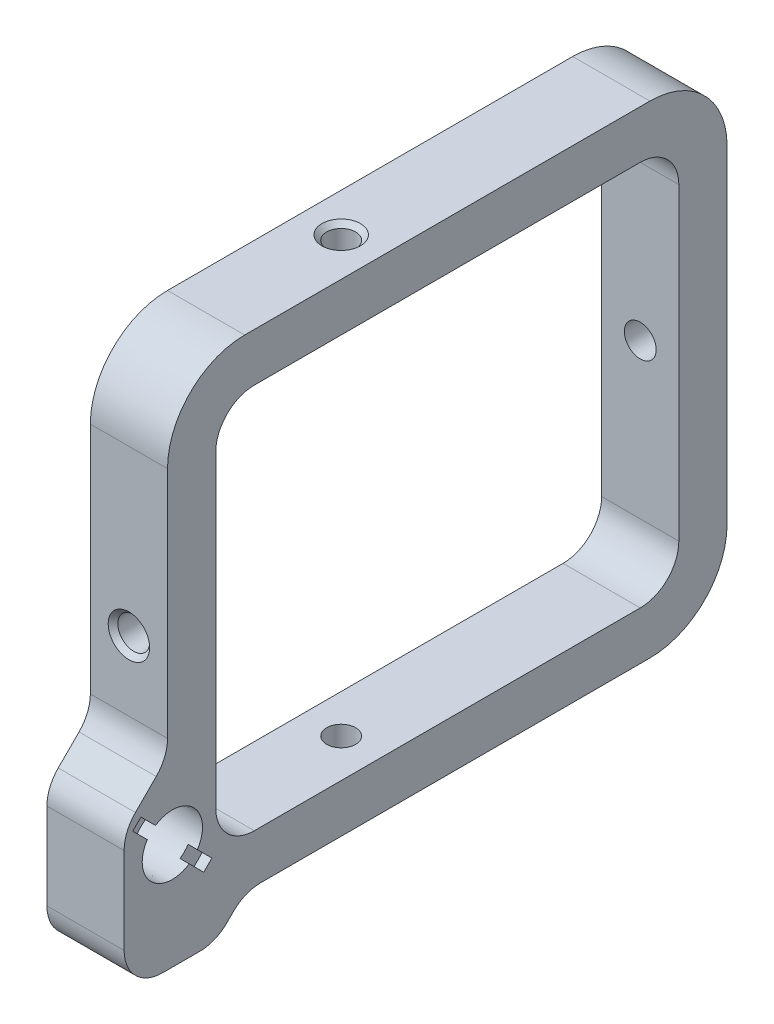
ISO-10303-21;
HEADER;
FILE_DESCRIPTION(('STEP AP214'),'2;1');
FILE_NAME('part.step','',(''),(''),'','','');
FILE_SCHEMA(('AUTOMOTIVE_DESIGN { 1 0 10303 214 1 1 1 1 }'));
ENDSEC;
DATA;
#1=APPLICATION_CONTEXT('core data for automotive mechanical design processes');
#2=APPLICATION_PROTOCOL_DEFINITION('international standard','automotive_design',2000,#1);
#3=PRODUCT_CONTEXT('',#1,'mechanical');
#4=PRODUCT('Part','Part','',(#3));
#5=PRODUCT_RELATED_PRODUCT_CATEGORY('part','',(#4));
#6=PRODUCT_DEFINITION_FORMATION('','',#4);
#7=PRODUCT_DEFINITION_CONTEXT('part definition',#1,'design');
#8=PRODUCT_DEFINITION('design','',#6,#7);
#9=PRODUCT_DEFINITION_SHAPE('','',#8);
#10=(LENGTH_UNIT() NAMED_UNIT(*) SI_UNIT(.MILLI.,.METRE.));
#11=(NAMED_UNIT(*) PLANE_ANGLE_UNIT() SI_UNIT($,.RADIAN.));
#12=(NAMED_UNIT(*) SI_UNIT($,.STERADIAN.) SOLID_ANGLE_UNIT());
#13=UNCERTAINTY_MEASURE_WITH_UNIT(LENGTH_MEASURE(1.E-05),#10,'distance_accuracy_value','');
#14=(GEOMETRIC_REPRESENTATION_CONTEXT(3) GLOBAL_UNCERTAINTY_ASSIGNED_CONTEXT((#13)) GLOBAL_UNIT_ASSIGNED_CONTEXT((#10,
#11,#12)) REPRESENTATION_CONTEXT('',''));
#15=CARTESIAN_POINT('',(0.,0.,0.));
#16=DIRECTION('',(0.,0.,1.));
#17=DIRECTION('',(1.,0.,0.));
#18=AXIS2_PLACEMENT_3D('',#15,#16,#17);
#19=CARTESIAN_POINT('',(8.,0.,0.));
#20=DIRECTION('',(1.,0.,0.));
#21=DIRECTION('',(0.,0.,-1.));
#22=AXIS2_PLACEMENT_3D('',#19,#20,#21);
#23=PLANE('',#22);
#24=DIRECTION('',(0.,0.707106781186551,0.707106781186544));
#25=VECTOR('',#24,1.);
#26=CARTESIAN_POINT('',(8.,-12.898780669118,60.7526911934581));
#27=LINE('',#26,#25);
#28=CARTESIAN_POINT('',(8.,-20.2526911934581,53.398780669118));
#29=VERTEX_POINT('',#28);
#30=CARTESIAN_POINT('',(8.,-18.7443328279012,54.907139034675));
#31=VERTEX_POINT('',#30);
#32=EDGE_CURVE('E284',#29,#31,#27,.T.);
#33=ORIENTED_EDGE('',*,*,#32,.F.);
#34=DIRECTION('',(0.,0.707106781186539,-0.707106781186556));
#35=VECTOR('',#34,1.);
#36=CARTESIAN_POINT('',(8.,-20.2526911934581,53.398780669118));
#37=LINE('',#36,#35);
#38=CARTESIAN_POINT('',(8.,-21.101219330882,54.2473088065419));
#39=VERTEX_POINT('',#38);
#40=EDGE_CURVE('E262',#39,#29,#37,.T.);
#41=ORIENTED_EDGE('',*,*,#40,.F.);
#42=DIRECTION('',(0.,-0.707106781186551,-0.707106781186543));
#43=VECTOR('',#42,1.);
#44=CARTESIAN_POINT('',(8.,-21.101219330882,54.2473088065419));
#45=LINE('',#44,#43);
#46=CARTESIAN_POINT('',(8.,-19.592860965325,55.7556671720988));
#47=VERTEX_POINT('',#46);
#48=EDGE_CURVE('E289',#47,#39,#45,.T.);
#49=ORIENTED_EDGE('',*,*,#48,.F.);
#50=CARTESIAN_POINT('',(8.,-17.,57.5));
#51=DIRECTION('',(1.,0.,0.));
#52=DIRECTION('',(0.,0.,-1.));
#53=AXIS2_PLACEMENT_3D('',#50,#51,#52);
#54=CIRCLE('',#53,3.125);
#55=CARTESIAN_POINT('',(8.,-15.2556671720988,60.092860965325));
#56=VERTEX_POINT('',#55);
#57=EDGE_CURVE('E311',#56,#47,#54,.T.);
#58=ORIENTED_EDGE('',*,*,#57,.F.);
#59=CARTESIAN_POINT('',(8.,-13.7473088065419,61.6012193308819));
#60=VERTEX_POINT('',#59);
#61=EDGE_CURVE('E290',#60,#56,#45,.T.);
#62=ORIENTED_EDGE('',*,*,#61,.F.);
#63=DIRECTION('',(0.,-0.707106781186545,0.70710678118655));
#64=VECTOR('',#63,1.);
#65=CARTESIAN_POINT('',(8.,-13.7473088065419,61.6012193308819));
#66=LINE('',#65,#64);
#67=CARTESIAN_POINT('',(8.,-12.898780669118,60.7526911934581));
#68=VERTEX_POINT('',#67);
#69=EDGE_CURVE('E287',#68,#60,#66,.T.);
#70=ORIENTED_EDGE('',*,*,#69,.F.);
#71=CARTESIAN_POINT('',(8.,-14.407139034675,59.2443328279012));
#72=VERTEX_POINT('',#71);
#73=EDGE_CURVE('E268',#72,#68,#27,.T.);
#74=ORIENTED_EDGE('',*,*,#73,.F.);
#75=EDGE_CURVE('E308',#31,#72,#54,.T.);
#76=ORIENTED_EDGE('',*,*,#75,.F.);
#77=EDGE_LOOP('',(#33,#41,#49,#58,#62,#70,#74,#76));
#78=FACE_BOUND('',#77,.T.);
#79=DIRECTION('',(0.,-1.,0.));
#80=VECTOR('',#79,1.);
#81=CARTESIAN_POINT('',(8.,20.,53.));
#82=LINE('',#81,#80);
#83=CARTESIAN_POINT('',(8.,16.,53.));
#84=VERTEX_POINT('',#83);
#85=CARTESIAN_POINT('',(8.,-16.,53.));
#86=VERTEX_POINT('',#85);
#87=EDGE_CURVE('E315',#84,#86,#82,.T.);
#88=ORIENTED_EDGE('',*,*,#87,.F.);
#89=CARTESIAN_POINT('',(8.,16.,49.));
#90=DIRECTION('',(1.,0.,0.));
#91=DIRECTION('',(0.,0.,-1.));
#92=AXIS2_PLACEMENT_3D('',#89,#90,#91);
#93=CIRCLE('',#92,4.);
#94=CARTESIAN_POINT('',(8.,20.,49.));
#95=VERTEX_POINT('',#94);
#96=EDGE_CURVE('E518',#84,#95,#93,.F.);
#97=ORIENTED_EDGE('',*,*,#96,.T.);
#98=DIRECTION('',(0.,0.,1.));
#99=VECTOR('',#98,1.);
#100=CARTESIAN_POINT('',(8.,20.,5.));
#101=LINE('',#100,#99);
#102=CARTESIAN_POINT('',(8.,20.,9.));
#103=VERTEX_POINT('',#102);
#104=EDGE_CURVE('E312',#103,#95,#101,.T.);
#105=ORIENTED_EDGE('',*,*,#104,.F.);
#106=CARTESIAN_POINT('',(8.,16.,9.));
#107=DIRECTION('',(1.,0.,0.));
#108=DIRECTION('',(0.,0.,-1.));
#109=AXIS2_PLACEMENT_3D('',#106,#107,#108);
#110=CIRCLE('',#109,4.);
#111=CARTESIAN_POINT('',(8.,16.,5.));
#112=VERTEX_POINT('',#111);
#113=EDGE_CURVE('E514',#103,#112,#110,.F.);
#114=ORIENTED_EDGE('',*,*,#113,.T.);
#115=DIRECTION('',(0.,1.,0.));
#116=VECTOR('',#115,1.);
#117=CARTESIAN_POINT('',(8.,-20.,5.));
#118=LINE('',#117,#116);
#119=CARTESIAN_POINT('',(8.,-16.,5.));
#120=VERTEX_POINT('',#119);
#121=EDGE_CURVE('E322',#120,#112,#118,.T.);
#122=ORIENTED_EDGE('',*,*,#121,.F.);
#123=CARTESIAN_POINT('',(8.,-16.,9.));
#124=DIRECTION('',(1.,0.,0.));
#125=DIRECTION('',(0.,0.,-1.));
#126=AXIS2_PLACEMENT_3D('',#123,#124,#125);
#127=CIRCLE('',#126,4.);
#128=CARTESIAN_POINT('',(8.,-20.,9.));
#129=VERTEX_POINT('',#128);
#130=EDGE_CURVE('E510',#120,#129,#127,.F.);
#131=ORIENTED_EDGE('',*,*,#130,.T.);
#132=DIRECTION('',(0.,0.,-1.));
#133=VECTOR('',#132,1.);
#134=CARTESIAN_POINT('',(8.,-20.,53.));
#135=LINE('',#134,#133);
#136=CARTESIAN_POINT('',(8.,-20.,49.));
#137=VERTEX_POINT('',#136);
#138=EDGE_CURVE('E319',#137,#129,#135,.T.);
#139=ORIENTED_EDGE('',*,*,#138,.F.);
#140=CARTESIAN_POINT('',(8.,-16.,49.));
#141=DIRECTION('',(1.,0.,0.));
#142=DIRECTION('',(0.,0.,-1.));
#143=AXIS2_PLACEMENT_3D('',#140,#141,#142);
#144=CIRCLE('',#143,4.);
#145=EDGE_CURVE('E506',#137,#86,#144,.F.);
#146=ORIENTED_EDGE('',*,*,#145,.T.);
#147=EDGE_LOOP('',(#88,#97,#105,#114,#122,#131,#139,#146));
#148=FACE_BOUND('',#147,.T.);
#149=DIRECTION('',(0.,0.,-1.));
#150=VECTOR('',#149,1.);
#151=CARTESIAN_POINT('',(8.,-25.,50.));
#152=LINE('',#151,#150);
#153=CARTESIAN_POINT('',(8.,-25.,48.3431457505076));
#154=VERTEX_POINT('',#153);
#155=CARTESIAN_POINT('',(8.,-25.,8.));
#156=VERTEX_POINT('',#155);
#157=EDGE_CURVE('E350',#154,#156,#152,.T.);
#158=ORIENTED_EDGE('',*,*,#157,.T.);
#159=CARTESIAN_POINT('',(8.,-17.,8.));
#160=DIRECTION('',(1.,0.,0.));
#161=DIRECTION('',(0.,0.,-1.));
#162=AXIS2_PLACEMENT_3D('',#159,#160,#161);
#163=CIRCLE('',#162,8.);
#164=CARTESIAN_POINT('',(8.,-17.,0.));
#165=VERTEX_POINT('',#164);
#166=EDGE_CURVE('E474',#156,#165,#163,.T.);
#167=ORIENTED_EDGE('',*,*,#166,.T.);
#168=DIRECTION('',(0.,1.,0.));
#169=VECTOR('',#168,1.);
#170=CARTESIAN_POINT('',(8.,-25.,0.));
#171=LINE('',#170,#169);
#172=CARTESIAN_POINT('',(8.,17.,0.));
#173=VERTEX_POINT('',#172);
#174=EDGE_CURVE('E353',#165,#173,#171,.T.);
#175=ORIENTED_EDGE('',*,*,#174,.T.);
#176=CARTESIAN_POINT('',(8.,17.,8.));
#177=DIRECTION('',(1.,0.,0.));
#178=DIRECTION('',(0.,0.,-1.));
#179=AXIS2_PLACEMENT_3D('',#176,#177,#178);
#180=CIRCLE('',#179,8.);
#181=CARTESIAN_POINT('',(8.,25.,8.));
#182=VERTEX_POINT('',#181);
#183=EDGE_CURVE('E472',#173,#182,#180,.T.);
#184=ORIENTED_EDGE('',*,*,#183,.T.);
#185=DIRECTION('',(0.,0.,1.));
#186=VECTOR('',#185,1.);
#187=CARTESIAN_POINT('',(8.,25.,0.));
#188=LINE('',#187,#186);
#189=CARTESIAN_POINT('',(8.,25.,50.));
#190=VERTEX_POINT('',#189);
#191=EDGE_CURVE('E356',#182,#190,#188,.T.);
#192=ORIENTED_EDGE('',*,*,#191,.T.);
#193=CARTESIAN_POINT('',(8.,17.,50.));
#194=DIRECTION('',(1.,0.,0.));
#195=DIRECTION('',(0.,0.,-1.));
#196=AXIS2_PLACEMENT_3D('',#193,#194,#195);
#197=CIRCLE('',#196,8.);
#198=CARTESIAN_POINT('',(8.,17.,58.));
#199=VERTEX_POINT('',#198);
#200=EDGE_CURVE('E470',#190,#199,#197,.T.);
#201=ORIENTED_EDGE('',*,*,#200,.T.);
#202=DIRECTION('',(0.,-1.,0.));
#203=VECTOR('',#202,1.);
#204=CARTESIAN_POINT('',(8.,25.,58.));
#205=LINE('',#204,#203);
#206=CARTESIAN_POINT('',(8.,-7.21814575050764,58.));
#207=VERTEX_POINT('',#206);
#208=EDGE_CURVE('E359',#199,#207,#205,.T.);
#209=ORIENTED_EDGE('',*,*,#208,.T.);
#210=CARTESIAN_POINT('',(8.,-7.21814575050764,62.));
#211=DIRECTION('',(1.,0.,0.));
#212=DIRECTION('',(0.,0.,-1.));
#213=AXIS2_PLACEMENT_3D('',#210,#211,#212);
#214=CIRCLE('',#213,4.);
#215=CARTESIAN_POINT('',(8.,-10.0465728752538,59.1715728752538));
#216=VERTEX_POINT('',#215);
#217=EDGE_CURVE('E455',#207,#216,#214,.F.);
#218=ORIENTED_EDGE('',*,*,#217,.T.);
#219=DIRECTION('',(0.,-0.707106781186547,0.707106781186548));
#220=VECTOR('',#219,1.);
#221=CARTESIAN_POINT('',(8.,-8.87500000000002,58.));
#222=LINE('',#221,#220);
#223=CARTESIAN_POINT('',(8.,-12.2034271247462,61.3284271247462));
#224=VERTEX_POINT('',#223);
#225=EDGE_CURVE('E337',#216,#224,#222,.T.);
#226=ORIENTED_EDGE('',*,*,#225,.T.);
#227=CARTESIAN_POINT('',(8.,-15.0318542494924,58.5));
#228=DIRECTION('',(1.,0.,0.));
#229=DIRECTION('',(0.,0.,-1.));
#230=AXIS2_PLACEMENT_3D('',#227,#228,#229);
#231=CIRCLE('',#230,4.);
#232=CARTESIAN_POINT('',(8.,-15.0318542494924,62.5));
#233=VERTEX_POINT('',#232);
#234=EDGE_CURVE('E426',#224,#233,#231,.T.);
#235=ORIENTED_EDGE('',*,*,#234,.T.);
#236=DIRECTION('',(0.,-1.,0.));
#237=VECTOR('',#236,1.);
#238=CARTESIAN_POINT('',(8.,-13.375,62.5));
#239=LINE('',#238,#237);
#240=CARTESIAN_POINT('',(8.,-24.,62.5));
#241=VERTEX_POINT('',#240);
#242=EDGE_CURVE('E340',#233,#241,#239,.T.);
#243=ORIENTED_EDGE('',*,*,#242,.T.);
#244=CARTESIAN_POINT('',(8.,-24.,58.5));
#245=DIRECTION('',(1.,0.,0.));
#246=DIRECTION('',(0.,0.,-1.));
#247=AXIS2_PLACEMENT_3D('',#244,#245,#246);
#248=CIRCLE('',#247,4.);
#249=CARTESIAN_POINT('',(8.,-28.,58.5));
#250=VERTEX_POINT('',#249);
#251=EDGE_CURVE('E428',#241,#250,#248,.T.);
#252=ORIENTED_EDGE('',*,*,#251,.T.);
#253=DIRECTION('',(0.,0.,-1.));
#254=VECTOR('',#253,1.);
#255=CARTESIAN_POINT('',(8.,-28.,62.5));
#256=LINE('',#255,#254);
#257=CARTESIAN_POINT('',(8.,-28.,54.6568542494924));
#258=VERTEX_POINT('',#257);
#259=EDGE_CURVE('E344',#250,#258,#256,.T.);
#260=ORIENTED_EDGE('',*,*,#259,.T.);
#261=CARTESIAN_POINT('',(8.,-24.,54.6568542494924));
#262=DIRECTION('',(1.,0.,0.));
#263=DIRECTION('',(0.,0.,-1.));
#264=AXIS2_PLACEMENT_3D('',#261,#262,#263);
#265=CIRCLE('',#264,4.);
#266=CARTESIAN_POINT('',(8.,-26.8284271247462,51.8284271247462));
#267=VERTEX_POINT('',#266);
#268=EDGE_CURVE('E430',#258,#267,#265,.T.);
#269=ORIENTED_EDGE('',*,*,#268,.T.);
#270=DIRECTION('',(0.,0.707106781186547,-0.707106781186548));
#271=VECTOR('',#270,1.);
#272=CARTESIAN_POINT('',(8.,-28.,53.));
#273=LINE('',#272,#271);
#274=CARTESIAN_POINT('',(8.,-26.1715728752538,51.1715728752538));
#275=VERTEX_POINT('',#274);
#276=EDGE_CURVE('E347',#267,#275,#273,.T.);
#277=ORIENTED_EDGE('',*,*,#276,.T.);
#278=CARTESIAN_POINT('',(8.,-29.,48.3431457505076));
#279=DIRECTION('',(1.,0.,0.));
#280=DIRECTION('',(0.,0.,-1.));
#281=AXIS2_PLACEMENT_3D('',#278,#279,#280);
#282=CIRCLE('',#281,4.);
#283=EDGE_CURVE('E450',#275,#154,#282,.F.);
#284=ORIENTED_EDGE('',*,*,#283,.T.);
#285=EDGE_LOOP('',(#158,#167,#175,#184,#192,#201,#209,#218,#226,#235,#243,#252,#260,#269,#277,#284));
#286=FACE_BOUND('',#285,.T.);
#287=ADVANCED_FACE('F41',(#78,#148,#286),#23,.T.);
#288=CARTESIAN_POINT('',(0.,0.,0.));
#289=DIRECTION('',(1.,0.,0.));
#290=DIRECTION('',(0.,0.,-1.));
#291=AXIS2_PLACEMENT_3D('',#288,#289,#290);
#292=PLANE('',#291);
#293=CARTESIAN_POINT('',(0.,-17.,57.5));
#294=DIRECTION('',(1.,0.,0.));
#295=DIRECTION('',(0.,0.,-1.));
#296=AXIS2_PLACEMENT_3D('',#293,#294,#295);
#297=CIRCLE('',#296,3.62499999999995);
#298=CARTESIAN_POINT('',(0.,-17.,53.875));
#299=VERTEX_POINT('',#298);
#300=EDGE_CURVE('E520',#299,#299,#297,.T.);
#301=ORIENTED_EDGE('',*,*,#300,.T.);
#302=EDGE_LOOP('',(#301));
#303=FACE_BOUND('',#302,.T.);
#304=DIRECTION('',(0.,1.,0.));
#305=VECTOR('',#304,1.);
#306=CARTESIAN_POINT('',(0.,-25.,0.));
#307=LINE('',#306,#305);
#308=CARTESIAN_POINT('',(0.,-17.,0.));
#309=VERTEX_POINT('',#308);
#310=CARTESIAN_POINT('',(0.,17.,0.));
#311=VERTEX_POINT('',#310);
#312=EDGE_CURVE('E376',#309,#311,#307,.T.);
#313=ORIENTED_EDGE('',*,*,#312,.F.);
#314=CARTESIAN_POINT('',(0.,-17.,8.));
#315=DIRECTION('',(1.,0.,0.));
#316=DIRECTION('',(0.,0.,-1.));
#317=AXIS2_PLACEMENT_3D('',#314,#315,#316);
#318=CIRCLE('',#317,8.);
#319=CARTESIAN_POINT('',(0.,-25.,8.));
#320=VERTEX_POINT('',#319);
#321=EDGE_CURVE('E466',#309,#320,#318,.F.);
#322=ORIENTED_EDGE('',*,*,#321,.T.);
#323=DIRECTION('',(0.,0.,-1.));
#324=VECTOR('',#323,1.);
#325=CARTESIAN_POINT('',(0.,-25.,50.));
#326=LINE('',#325,#324);
#327=CARTESIAN_POINT('',(0.,-25.,48.3431457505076));
#328=VERTEX_POINT('',#327);
#329=EDGE_CURVE('E373',#328,#320,#326,.T.);
#330=ORIENTED_EDGE('',*,*,#329,.F.);
#331=CARTESIAN_POINT('',(0.,-29.,48.3431457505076));
#332=DIRECTION('',(1.,0.,0.));
#333=DIRECTION('',(0.,0.,-1.));
#334=AXIS2_PLACEMENT_3D('',#331,#332,#333);
#335=CIRCLE('',#334,4.);
#336=CARTESIAN_POINT('',(0.,-26.1715728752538,51.1715728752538));
#337=VERTEX_POINT('',#336);
#338=EDGE_CURVE('E448',#328,#337,#335,.T.);
#339=ORIENTED_EDGE('',*,*,#338,.T.);
#340=DIRECTION('',(0.,0.707106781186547,-0.707106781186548));
#341=VECTOR('',#340,1.);
#342=CARTESIAN_POINT('',(0.,-28.,53.));
#343=LINE('',#342,#341);
#344=CARTESIAN_POINT('',(0.,-26.8284271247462,51.8284271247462));
#345=VERTEX_POINT('',#344);
#346=EDGE_CURVE('E370',#345,#337,#343,.T.);
#347=ORIENTED_EDGE('',*,*,#346,.F.);
#348=CARTESIAN_POINT('',(0.,-24.,54.6568542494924));
#349=DIRECTION('',(1.,0.,0.));
#350=DIRECTION('',(0.,0.,-1.));
#351=AXIS2_PLACEMENT_3D('',#348,#349,#350);
#352=CIRCLE('',#351,4.);
#353=CARTESIAN_POINT('',(0.,-28.,54.6568542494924));
#354=VERTEX_POINT('',#353);
#355=EDGE_CURVE('E419',#345,#354,#352,.F.);
#356=ORIENTED_EDGE('',*,*,#355,.T.);
#357=DIRECTION('',(0.,0.,-1.));
#358=VECTOR('',#357,1.);
#359=CARTESIAN_POINT('',(0.,-28.,62.5));
#360=LINE('',#359,#358);
#361=CARTESIAN_POINT('',(0.,-28.,58.5));
#362=VERTEX_POINT('',#361);
#363=EDGE_CURVE('E367',#362,#354,#360,.T.);
#364=ORIENTED_EDGE('',*,*,#363,.F.);
#365=CARTESIAN_POINT('',(0.,-24.,58.5));
#366=DIRECTION('',(1.,0.,0.));
#367=DIRECTION('',(0.,0.,-1.));
#368=AXIS2_PLACEMENT_3D('',#365,#366,#367);
#369=CIRCLE('',#368,4.);
#370=CARTESIAN_POINT('',(0.,-24.,62.5));
#371=VERTEX_POINT('',#370);
#372=EDGE_CURVE('E417',#362,#371,#369,.F.);
#373=ORIENTED_EDGE('',*,*,#372,.T.);
#374=DIRECTION('',(0.,-1.,0.));
#375=VECTOR('',#374,1.);
#376=CARTESIAN_POINT('',(0.,-13.375,62.5));
#377=LINE('',#376,#375);
#378=CARTESIAN_POINT('',(0.,-15.0318542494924,62.5));
#379=VERTEX_POINT('',#378);
#380=EDGE_CURVE('E364',#379,#371,#377,.T.);
#381=ORIENTED_EDGE('',*,*,#380,.F.);
#382=CARTESIAN_POINT('',(0.,-15.0318542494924,58.5));
#383=DIRECTION('',(1.,0.,0.));
#384=DIRECTION('',(0.,0.,-1.));
#385=AXIS2_PLACEMENT_3D('',#382,#383,#384);
#386=CIRCLE('',#385,4.);
#387=CARTESIAN_POINT('',(0.,-12.2034271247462,61.3284271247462));
#388=VERTEX_POINT('',#387);
#389=EDGE_CURVE('E415',#379,#388,#386,.F.);
#390=ORIENTED_EDGE('',*,*,#389,.T.);
#391=DIRECTION('',(0.,-0.707106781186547,0.707106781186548));
#392=VECTOR('',#391,1.);
#393=CARTESIAN_POINT('',(0.,-8.87500000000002,58.));
#394=LINE('',#393,#392);
#395=CARTESIAN_POINT('',(0.,-10.0465728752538,59.1715728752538));
#396=VERTEX_POINT('',#395);
#397=EDGE_CURVE('E325',#396,#388,#394,.T.);
#398=ORIENTED_EDGE('',*,*,#397,.F.);
#399=CARTESIAN_POINT('',(0.,-7.21814575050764,62.));
#400=DIRECTION('',(1.,0.,0.));
#401=DIRECTION('',(0.,0.,-1.));
#402=AXIS2_PLACEMENT_3D('',#399,#400,#401);
#403=CIRCLE('',#402,4.);
#404=CARTESIAN_POINT('',(0.,-7.21814575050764,58.));
#405=VERTEX_POINT('',#404);
#406=EDGE_CURVE('E452',#396,#405,#403,.T.);
#407=ORIENTED_EDGE('',*,*,#406,.T.);
#408=DIRECTION('',(0.,-1.,0.));
#409=VECTOR('',#408,1.);
#410=CARTESIAN_POINT('',(0.,25.,58.));
#411=LINE('',#410,#409);
#412=CARTESIAN_POINT('',(0.,17.,58.));
#413=VERTEX_POINT('',#412);
#414=EDGE_CURVE('E341',#413,#405,#411,.T.);
#415=ORIENTED_EDGE('',*,*,#414,.F.);
#416=CARTESIAN_POINT('',(0.,17.,50.));
#417=DIRECTION('',(1.,0.,0.));
#418=DIRECTION('',(0.,0.,-1.));
#419=AXIS2_PLACEMENT_3D('',#416,#417,#418);
#420=CIRCLE('',#419,8.);
#421=CARTESIAN_POINT('',(0.,25.,50.));
#422=VERTEX_POINT('',#421);
#423=EDGE_CURVE('E462',#413,#422,#420,.F.);
#424=ORIENTED_EDGE('',*,*,#423,.T.);
#425=DIRECTION('',(0.,0.,1.));
#426=VECTOR('',#425,1.);
#427=CARTESIAN_POINT('',(0.,25.,0.));
#428=LINE('',#427,#426);
#429=CARTESIAN_POINT('',(0.,25.,8.));
#430=VERTEX_POINT('',#429);
#431=EDGE_CURVE('E379',#430,#422,#428,.T.);
#432=ORIENTED_EDGE('',*,*,#431,.F.);
#433=CARTESIAN_POINT('',(0.,17.,8.));
#434=DIRECTION('',(1.,0.,0.));
#435=DIRECTION('',(0.,0.,-1.));
#436=AXIS2_PLACEMENT_3D('',#433,#434,#435);
#437=CIRCLE('',#436,8.);
#438=EDGE_CURVE('E464',#430,#311,#437,.F.);
#439=ORIENTED_EDGE('',*,*,#438,.T.);
#440=EDGE_LOOP('',(#313,#322,#330,#339,#347,#356,#364,#373,#381,#390,#398,#407,#415,#424,#432,#439));
#441=FACE_BOUND('',#440,.T.);
#442=DIRECTION('',(0.,1.,0.));
#443=VECTOR('',#442,1.);
#444=CARTESIAN_POINT('',(0.,-20.,5.));
#445=LINE('',#444,#443);
#446=CARTESIAN_POINT('',(0.,-16.,5.));
#447=VERTEX_POINT('',#446);
#448=CARTESIAN_POINT('',(0.,16.,5.));
#449=VERTEX_POINT('',#448);
#450=EDGE_CURVE('E316',#447,#449,#445,.T.);
#451=ORIENTED_EDGE('',*,*,#450,.T.);
#452=CARTESIAN_POINT('',(0.,16.,9.));
#453=DIRECTION('',(1.,0.,0.));
#454=DIRECTION('',(0.,0.,-1.));
#455=AXIS2_PLACEMENT_3D('',#452,#453,#454);
#456=CIRCLE('',#455,4.);
#457=CARTESIAN_POINT('',(0.,20.,9.));
#458=VERTEX_POINT('',#457);
#459=EDGE_CURVE('E512',#449,#458,#456,.T.);
#460=ORIENTED_EDGE('',*,*,#459,.T.);
#461=DIRECTION('',(0.,0.,1.));
#462=VECTOR('',#461,1.);
#463=CARTESIAN_POINT('',(0.,20.,5.));
#464=LINE('',#463,#462);
#465=CARTESIAN_POINT('',(0.,20.,49.));
#466=VERTEX_POINT('',#465);
#467=EDGE_CURVE('E326',#458,#466,#464,.T.);
#468=ORIENTED_EDGE('',*,*,#467,.T.);
#469=CARTESIAN_POINT('',(0.,16.,49.));
#470=DIRECTION('',(1.,0.,0.));
#471=DIRECTION('',(0.,0.,-1.));
#472=AXIS2_PLACEMENT_3D('',#469,#470,#471);
#473=CIRCLE('',#472,4.);
#474=CARTESIAN_POINT('',(0.,16.,53.));
#475=VERTEX_POINT('',#474);
#476=EDGE_CURVE('E516',#466,#475,#473,.T.);
#477=ORIENTED_EDGE('',*,*,#476,.T.);
#478=DIRECTION('',(0.,-1.,0.));
#479=VECTOR('',#478,1.);
#480=CARTESIAN_POINT('',(0.,20.,53.));
#481=LINE('',#480,#479);
#482=CARTESIAN_POINT('',(0.,-16.,53.));
#483=VERTEX_POINT('',#482);
#484=EDGE_CURVE('E329',#475,#483,#481,.T.);
#485=ORIENTED_EDGE('',*,*,#484,.T.);
#486=CARTESIAN_POINT('',(0.,-16.,49.));
#487=DIRECTION('',(1.,0.,0.));
#488=DIRECTION('',(0.,0.,-1.));
#489=AXIS2_PLACEMENT_3D('',#486,#487,#488);
#490=CIRCLE('',#489,4.);
#491=CARTESIAN_POINT('',(0.,-20.,49.));
#492=VERTEX_POINT('',#491);
#493=EDGE_CURVE('E504',#483,#492,#490,.T.);
#494=ORIENTED_EDGE('',*,*,#493,.T.);
#495=DIRECTION('',(0.,0.,-1.));
#496=VECTOR('',#495,1.);
#497=CARTESIAN_POINT('',(0.,-20.,53.));
#498=LINE('',#497,#496);
#499=CARTESIAN_POINT('',(0.,-20.,9.));
#500=VERTEX_POINT('',#499);
#501=EDGE_CURVE('E332',#492,#500,#498,.T.);
#502=ORIENTED_EDGE('',*,*,#501,.T.);
#503=CARTESIAN_POINT('',(0.,-16.,9.));
#504=DIRECTION('',(1.,0.,0.));
#505=DIRECTION('',(0.,0.,-1.));
#506=AXIS2_PLACEMENT_3D('',#503,#504,#505);
#507=CIRCLE('',#506,4.);
#508=EDGE_CURVE('E508',#500,#447,#507,.T.);
#509=ORIENTED_EDGE('',*,*,#508,.T.);
#510=EDGE_LOOP('',(#451,#460,#468,#477,#485,#494,#502,#509));
#511=FACE_BOUND('',#510,.T.);
#512=ADVANCED_FACE('F567',(#303,#441,#511),#292,.F.);
#513=CARTESIAN_POINT('',(8.,-8.87500000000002,58.));
#514=DIRECTION('',(0.,-0.707106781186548,-0.707106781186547));
#515=DIRECTION('',(0.,0.707106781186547,-0.707106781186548));
#516=AXIS2_PLACEMENT_3D('',#513,#514,#515);
#517=PLANE('',#516);
#518=ORIENTED_EDGE('',*,*,#397,.T.);
#519=DIRECTION('',(-1.,0.,0.));
#520=VECTOR('',#519,1.);
#521=CARTESIAN_POINT('',(8.,-12.2034271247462,61.3284271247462));
#522=LINE('',#521,#520);
#523=EDGE_CURVE('E443',#388,#224,#522,.F.);
#524=ORIENTED_EDGE('',*,*,#523,.T.);
#525=ORIENTED_EDGE('',*,*,#225,.F.);
#526=DIRECTION('',(-1.,0.,0.));
#527=VECTOR('',#526,1.);
#528=CARTESIAN_POINT('',(0.,-10.0465728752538,59.1715728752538));
#529=LINE('',#528,#527);
#530=EDGE_CURVE('E440',#216,#396,#529,.T.);
#531=ORIENTED_EDGE('',*,*,#530,.T.);
#532=EDGE_LOOP('',(#518,#524,#525,#531));
#533=FACE_BOUND('',#532,.T.);
#534=ADVANCED_FACE('F571',(#533),#517,.F.);
#535=CARTESIAN_POINT('',(8.,-13.375,62.5));
#536=DIRECTION('',(0.,0.,-1.));
#537=DIRECTION('',(0.,1.,0.));
#538=AXIS2_PLACEMENT_3D('',#535,#536,#537);
#539=PLANE('',#538);
#540=ORIENTED_EDGE('',*,*,#380,.T.);
#541=DIRECTION('',(-1.,0.,0.));
#542=VECTOR('',#541,1.);
#543=CARTESIAN_POINT('',(8.,-24.,62.5));
#544=LINE('',#543,#542);
#545=EDGE_CURVE('E438',#371,#241,#544,.F.);
#546=ORIENTED_EDGE('',*,*,#545,.T.);
#547=ORIENTED_EDGE('',*,*,#242,.F.);
#548=DIRECTION('',(-1.,0.,0.));
#549=VECTOR('',#548,1.);
#550=CARTESIAN_POINT('',(8.,-15.0318542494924,62.5));
#551=LINE('',#550,#549);
#552=EDGE_CURVE('E435',#233,#379,#551,.T.);
#553=ORIENTED_EDGE('',*,*,#552,.T.);
#554=EDGE_LOOP('',(#540,#546,#547,#553));
#555=FACE_BOUND('',#554,.T.);
#556=ADVANCED_FACE('F595',(#555),#539,.F.);
#557=CARTESIAN_POINT('',(8.,-28.,62.5));
#558=DIRECTION('',(0.,1.,0.));
#559=DIRECTION('',(0.,0.,1.));
#560=AXIS2_PLACEMENT_3D('',#557,#558,#559);
#561=PLANE('',#560);
#562=ORIENTED_EDGE('',*,*,#363,.T.);
#563=DIRECTION('',(-1.,0.,0.));
#564=VECTOR('',#563,1.);
#565=CARTESIAN_POINT('',(8.,-28.,54.6568542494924));
#566=LINE('',#565,#564);
#567=EDGE_CURVE('E424',#354,#258,#566,.F.);
#568=ORIENTED_EDGE('',*,*,#567,.T.);
#569=ORIENTED_EDGE('',*,*,#259,.F.);
#570=DIRECTION('',(-1.,0.,0.));
#571=VECTOR('',#570,1.);
#572=CARTESIAN_POINT('',(8.,-28.,58.5));
#573=LINE('',#572,#571);
#574=EDGE_CURVE('E421',#250,#362,#573,.T.);
#575=ORIENTED_EDGE('',*,*,#574,.T.);
#576=EDGE_LOOP('',(#562,#568,#569,#575));
#577=FACE_BOUND('',#576,.T.);
#578=ADVANCED_FACE('F591',(#577),#561,.F.);
#579=CARTESIAN_POINT('',(8.,-28.,53.));
#580=DIRECTION('',(0.,0.707106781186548,0.707106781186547));
#581=DIRECTION('',(0.,-0.707106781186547,0.707106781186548));
#582=AXIS2_PLACEMENT_3D('',#579,#580,#581);
#583=PLANE('',#582);
#584=ORIENTED_EDGE('',*,*,#276,.F.);
#585=DIRECTION('',(-1.,0.,0.));
#586=VECTOR('',#585,1.);
#587=CARTESIAN_POINT('',(8.,-26.8284271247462,51.8284271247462));
#588=LINE('',#587,#586);
#589=EDGE_CURVE('E412',#267,#345,#588,.T.);
#590=ORIENTED_EDGE('',*,*,#589,.T.);
#591=ORIENTED_EDGE('',*,*,#346,.T.);
#592=DIRECTION('',(-1.,0.,0.));
#593=VECTOR('',#592,1.);
#594=CARTESIAN_POINT('',(8.,-26.1715728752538,51.1715728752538));
#595=LINE('',#594,#593);
#596=EDGE_CURVE('E410',#337,#275,#595,.F.);
#597=ORIENTED_EDGE('',*,*,#596,.T.);
#598=EDGE_LOOP('',(#584,#590,#591,#597));
#599=FACE_BOUND('',#598,.T.);
#600=ADVANCED_FACE('F587',(#599),#583,.F.);
#601=CARTESIAN_POINT('',(8.,-25.,50.));
#602=DIRECTION('',(0.,1.,0.));
#603=DIRECTION('',(0.,0.,1.));
#604=AXIS2_PLACEMENT_3D('',#601,#602,#603);
#605=PLANE('',#604);
#606=CARTESIAN_POINT('',(4.,-25.,36.));
#607=DIRECTION('',(0.,1.,0.));
#608=DIRECTION('',(0.,0.,1.));
#609=AXIS2_PLACEMENT_3D('',#606,#607,#608);
#610=CIRCLE('',#609,1.99999999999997);
#611=CARTESIAN_POINT('',(4.,-25.,38.));
#612=VERTEX_POINT('',#611);
#613=EDGE_CURVE('E407',#612,#612,#610,.T.);
#614=ORIENTED_EDGE('',*,*,#613,.T.);
#615=EDGE_LOOP('',(#614));
#616=FACE_BOUND('',#615,.T.);
#617=ORIENTED_EDGE('',*,*,#329,.T.);
#618=DIRECTION('',(-1.,0.,0.));
#619=VECTOR('',#618,1.);
#620=CARTESIAN_POINT('',(8.,-25.,8.));
#621=LINE('',#620,#619);
#622=EDGE_CURVE('E468',#320,#156,#621,.F.);
#623=ORIENTED_EDGE('',*,*,#622,.T.);
#624=ORIENTED_EDGE('',*,*,#157,.F.);
#625=DIRECTION('',(-1.,0.,0.));
#626=VECTOR('',#625,1.);
#627=CARTESIAN_POINT('',(0.,-25.,48.3431457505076));
#628=LINE('',#627,#626);
#629=EDGE_CURVE('E432',#154,#328,#628,.T.);
#630=ORIENTED_EDGE('',*,*,#629,.T.);
#631=EDGE_LOOP('',(#617,#623,#624,#630));
#632=FACE_BOUND('',#631,.T.);
#633=ADVANCED_FACE('F583',(#616,#632),#605,.F.);
#634=CARTESIAN_POINT('',(8.,-25.,0.));
#635=DIRECTION('',(0.,0.,1.));
#636=DIRECTION('',(1.,0.,0.));
#637=AXIS2_PLACEMENT_3D('',#634,#635,#636);
#638=PLANE('',#637);
#639=CARTESIAN_POINT('',(4.,0.,0.));
#640=DIRECTION('',(0.,0.,1.));
#641=DIRECTION('',(1.,0.,0.));
#642=AXIS2_PLACEMENT_3D('',#639,#640,#641);
#643=CIRCLE('',#642,2.15000000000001);
#644=CARTESIAN_POINT('',(6.15000000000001,0.,0.));
#645=VERTEX_POINT('',#644);
#646=EDGE_CURVE('E395',#645,#645,#643,.T.);
#647=ORIENTED_EDGE('',*,*,#646,.T.);
#648=EDGE_LOOP('',(#647));
#649=FACE_BOUND('',#648,.T.);
#650=ORIENTED_EDGE('',*,*,#174,.F.);
#651=DIRECTION('',(-1.,0.,0.));
#652=VECTOR('',#651,1.);
#653=CARTESIAN_POINT('',(8.,-17.,0.));
#654=LINE('',#653,#652);
#655=EDGE_CURVE('E459',#165,#309,#654,.T.);
#656=ORIENTED_EDGE('',*,*,#655,.T.);
#657=ORIENTED_EDGE('',*,*,#312,.T.);
#658=DIRECTION('',(-1.,0.,0.));
#659=VECTOR('',#658,1.);
#660=CARTESIAN_POINT('',(8.,17.,0.));
#661=LINE('',#660,#659);
#662=EDGE_CURVE('E457',#311,#173,#661,.F.);
#663=ORIENTED_EDGE('',*,*,#662,.T.);
#664=EDGE_LOOP('',(#650,#656,#657,#663));
#665=FACE_BOUND('',#664,.T.);
#666=ADVANCED_FACE('F579',(#649,#665),#638,.F.);
#667=CARTESIAN_POINT('',(8.,25.,0.));
#668=DIRECTION('',(0.,-1.,0.));
#669=DIRECTION('',(0.,0.,-1.));
#670=AXIS2_PLACEMENT_3D('',#667,#668,#669);
#671=PLANE('',#670);
#672=CARTESIAN_POINT('',(4.,25.,36.));
#673=DIRECTION('',(0.,-1.,0.));
#674=DIRECTION('',(0.,0.,-1.));
#675=AXIS2_PLACEMENT_3D('',#672,#673,#674);
#676=CIRCLE('',#675,1.99999999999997);
#677=CARTESIAN_POINT('',(4.,25.,34.));
#678=VERTEX_POINT('',#677);
#679=EDGE_CURVE('E398',#678,#678,#676,.T.);
#680=ORIENTED_EDGE('',*,*,#679,.T.);
#681=EDGE_LOOP('',(#680));
#682=FACE_BOUND('',#681,.T.);
#683=ORIENTED_EDGE('',*,*,#191,.F.);
#684=DIRECTION('',(-1.,0.,0.));
#685=VECTOR('',#684,1.);
#686=CARTESIAN_POINT('',(8.,25.,8.));
#687=LINE('',#686,#685);
#688=EDGE_CURVE('E478',#182,#430,#687,.T.);
#689=ORIENTED_EDGE('',*,*,#688,.T.);
#690=ORIENTED_EDGE('',*,*,#431,.T.);
#691=DIRECTION('',(-1.,0.,0.));
#692=VECTOR('',#691,1.);
#693=CARTESIAN_POINT('',(8.,25.,50.));
#694=LINE('',#693,#692);
#695=EDGE_CURVE('E476',#422,#190,#694,.F.);
#696=ORIENTED_EDGE('',*,*,#695,.T.);
#697=EDGE_LOOP('',(#683,#689,#690,#696));
#698=FACE_BOUND('',#697,.T.);
#699=ADVANCED_FACE('F575',(#682,#698),#671,.F.);
#700=CARTESIAN_POINT('',(8.,25.,58.));
#701=DIRECTION('',(0.,0.,-1.));
#702=DIRECTION('',(0.,1.,0.));
#703=AXIS2_PLACEMENT_3D('',#700,#701,#702);
#704=PLANE('',#703);
#705=CARTESIAN_POINT('',(4.,0.,58.));
#706=DIRECTION('',(0.,0.,-1.));
#707=DIRECTION('',(0.,1.,0.));
#708=AXIS2_PLACEMENT_3D('',#705,#706,#707);
#709=CIRCLE('',#708,2.15000000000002);
#710=CARTESIAN_POINT('',(4.,2.15000000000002,58.));
#711=VERTEX_POINT('',#710);
#712=EDGE_CURVE('E361',#711,#711,#709,.T.);
#713=ORIENTED_EDGE('',*,*,#712,.T.);
#714=EDGE_LOOP('',(#713));
#715=FACE_BOUND('',#714,.T.);
#716=ORIENTED_EDGE('',*,*,#208,.F.);
#717=DIRECTION('',(-1.,0.,0.));
#718=VECTOR('',#717,1.);
#719=CARTESIAN_POINT('',(8.,17.,58.));
#720=LINE('',#719,#718);
#721=EDGE_CURVE('E481',#199,#413,#720,.T.);
#722=ORIENTED_EDGE('',*,*,#721,.T.);
#723=ORIENTED_EDGE('',*,*,#414,.T.);
#724=DIRECTION('',(-1.,0.,0.));
#725=VECTOR('',#724,1.);
#726=CARTESIAN_POINT('',(8.,-7.21814575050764,58.));
#727=LINE('',#726,#725);
#728=EDGE_CURVE('E445',#405,#207,#727,.F.);
#729=ORIENTED_EDGE('',*,*,#728,.T.);
#730=EDGE_LOOP('',(#716,#722,#723,#729));
#731=FACE_BOUND('',#730,.T.);
#732=ADVANCED_FACE('F563',(#715,#731),#704,.F.);
#733=CARTESIAN_POINT('',(8.,20.,5.));
#734=DIRECTION('',(0.,-1.,0.));
#735=DIRECTION('',(0.,0.,-1.));
#736=AXIS2_PLACEMENT_3D('',#733,#734,#735);
#737=PLANE('',#736);
#738=CARTESIAN_POINT('',(4.,20.,36.));
#739=DIRECTION('',(0.,-1.,0.));
#740=DIRECTION('',(0.,0.,-1.));
#741=AXIS2_PLACEMENT_3D('',#738,#739,#740);
#742=CIRCLE('',#741,1.5);
#743=CARTESIAN_POINT('',(4.,20.,34.5));
#744=VERTEX_POINT('',#743);
#745=EDGE_CURVE('E305',#744,#744,#742,.T.);
#746=ORIENTED_EDGE('',*,*,#745,.F.);
#747=EDGE_LOOP('',(#746));
#748=FACE_BOUND('',#747,.T.);
#749=ORIENTED_EDGE('',*,*,#467,.F.);
#750=DIRECTION('',(-1.,0.,0.));
#751=VECTOR('',#750,1.);
#752=CARTESIAN_POINT('',(8.,20.,9.));
#753=LINE('',#752,#751);
#754=EDGE_CURVE('E502',#458,#103,#753,.F.);
#755=ORIENTED_EDGE('',*,*,#754,.T.);
#756=ORIENTED_EDGE('',*,*,#104,.T.);
#757=DIRECTION('',(-1.,0.,0.));
#758=VECTOR('',#757,1.);
#759=CARTESIAN_POINT('',(0.,20.,49.));
#760=LINE('',#759,#758);
#761=EDGE_CURVE('E499',#95,#466,#760,.T.);
#762=ORIENTED_EDGE('',*,*,#761,.T.);
#763=EDGE_LOOP('',(#749,#755,#756,#762));
#764=FACE_BOUND('',#763,.T.);
#765=ADVANCED_FACE('F559',(#748,#764),#737,.T.);
#766=CARTESIAN_POINT('',(8.,20.,53.));
#767=DIRECTION('',(0.,0.,-1.));
#768=DIRECTION('',(0.,1.,0.));
#769=AXIS2_PLACEMENT_3D('',#766,#767,#768);
#770=PLANE('',#769);
#771=CARTESIAN_POINT('',(4.,0.,53.));
#772=DIRECTION('',(0.,0.,-1.));
#773=DIRECTION('',(0.,1.,0.));
#774=AXIS2_PLACEMENT_3D('',#771,#772,#773);
#775=CIRCLE('',#774,1.65);
#776=CARTESIAN_POINT('',(4.,1.65,53.));
#777=VERTEX_POINT('',#776);
#778=EDGE_CURVE('E301',#777,#777,#775,.T.);
#779=ORIENTED_EDGE('',*,*,#778,.F.);
#780=EDGE_LOOP('',(#779));
#781=FACE_BOUND('',#780,.T.);
#782=ORIENTED_EDGE('',*,*,#87,.T.);
#783=DIRECTION('',(-1.,0.,0.));
#784=VECTOR('',#783,1.);
#785=CARTESIAN_POINT('',(0.,-16.,53.));
#786=LINE('',#785,#784);
#787=EDGE_CURVE('E486',#86,#483,#786,.T.);
#788=ORIENTED_EDGE('',*,*,#787,.T.);
#789=ORIENTED_EDGE('',*,*,#484,.F.);
#790=DIRECTION('',(-1.,0.,0.));
#791=VECTOR('',#790,1.);
#792=CARTESIAN_POINT('',(8.,16.,53.));
#793=LINE('',#792,#791);
#794=EDGE_CURVE('E484',#475,#84,#793,.F.);
#795=ORIENTED_EDGE('',*,*,#794,.T.);
#796=EDGE_LOOP('',(#782,#788,#789,#795));
#797=FACE_BOUND('',#796,.T.);
#798=ADVANCED_FACE('F555',(#781,#797),#770,.T.);
#799=CARTESIAN_POINT('',(8.,-20.,53.));
#800=DIRECTION('',(0.,1.,0.));
#801=DIRECTION('',(0.,0.,1.));
#802=AXIS2_PLACEMENT_3D('',#799,#800,#801);
#803=PLANE('',#802);
#804=CARTESIAN_POINT('',(4.,-20.,36.));
#805=DIRECTION('',(0.,1.,0.));
#806=DIRECTION('',(0.,0.,1.));
#807=AXIS2_PLACEMENT_3D('',#804,#805,#806);
#808=CIRCLE('',#807,1.5);
#809=CARTESIAN_POINT('',(4.,-20.,37.5));
#810=VERTEX_POINT('',#809);
#811=EDGE_CURVE('E304',#810,#810,#808,.T.);
#812=ORIENTED_EDGE('',*,*,#811,.F.);
#813=EDGE_LOOP('',(#812));
#814=FACE_BOUND('',#813,.T.);
#815=ORIENTED_EDGE('',*,*,#501,.F.);
#816=DIRECTION('',(-1.,0.,0.));
#817=VECTOR('',#816,1.);
#818=CARTESIAN_POINT('',(8.,-20.,49.));
#819=LINE('',#818,#817);
#820=EDGE_CURVE('E492',#492,#137,#819,.F.);
#821=ORIENTED_EDGE('',*,*,#820,.T.);
#822=ORIENTED_EDGE('',*,*,#138,.T.);
#823=DIRECTION('',(-1.,0.,0.));
#824=VECTOR('',#823,1.);
#825=CARTESIAN_POINT('',(0.,-20.,9.));
#826=LINE('',#825,#824);
#827=EDGE_CURVE('E489',#129,#500,#826,.T.);
#828=ORIENTED_EDGE('',*,*,#827,.T.);
#829=EDGE_LOOP('',(#815,#821,#822,#828));
#830=FACE_BOUND('',#829,.T.);
#831=ADVANCED_FACE('F551',(#814,#830),#803,.T.);
#832=CARTESIAN_POINT('',(8.,-20.,5.));
#833=DIRECTION('',(0.,0.,1.));
#834=DIRECTION('',(1.,0.,0.));
#835=AXIS2_PLACEMENT_3D('',#832,#833,#834);
#836=PLANE('',#835);
#837=CARTESIAN_POINT('',(4.,0.,5.));
#838=DIRECTION('',(0.,0.,1.));
#839=DIRECTION('',(1.,0.,0.));
#840=AXIS2_PLACEMENT_3D('',#837,#838,#839);
#841=CIRCLE('',#840,1.65);
#842=CARTESIAN_POINT('',(5.65,0.,5.));
#843=VERTEX_POINT('',#842);
#844=EDGE_CURVE('E296',#843,#843,#841,.T.);
#845=ORIENTED_EDGE('',*,*,#844,.F.);
#846=EDGE_LOOP('',(#845));
#847=FACE_BOUND('',#846,.T.);
#848=ORIENTED_EDGE('',*,*,#450,.F.);
#849=DIRECTION('',(-1.,0.,0.));
#850=VECTOR('',#849,1.);
#851=CARTESIAN_POINT('',(8.,-16.,5.));
#852=LINE('',#851,#850);
#853=EDGE_CURVE('E497',#447,#120,#852,.F.);
#854=ORIENTED_EDGE('',*,*,#853,.T.);
#855=ORIENTED_EDGE('',*,*,#121,.T.);
#856=DIRECTION('',(-1.,0.,0.));
#857=VECTOR('',#856,1.);
#858=CARTESIAN_POINT('',(0.,16.,5.));
#859=LINE('',#858,#857);
#860=EDGE_CURVE('E494',#112,#449,#859,.T.);
#861=ORIENTED_EDGE('',*,*,#860,.T.);
#862=EDGE_LOOP('',(#848,#854,#855,#861));
#863=FACE_BOUND('',#862,.T.);
#864=ADVANCED_FACE('F547',(#847,#863),#836,.T.);
#865=CARTESIAN_POINT('',(4.,25.,36.));
#866=DIRECTION('',(0.,-1.,0.));
#867=DIRECTION('',(0.,0.,-1.));
#868=AXIS2_PLACEMENT_3D('',#865,#866,#867);
#869=CYLINDRICAL_SURFACE('',#868,1.5);
#870=CARTESIAN_POINT('',(4.,-24.5,36.));
#871=DIRECTION('',(0.,1.,0.));
#872=DIRECTION('',(0.,0.,1.));
#873=AXIS2_PLACEMENT_3D('',#870,#871,#872);
#874=CIRCLE('',#873,1.5);
#875=CARTESIAN_POINT('',(4.,-24.5,37.5));
#876=VERTEX_POINT('',#875);
#877=EDGE_CURVE('E404',#876,#876,#874,.F.);
#878=ORIENTED_EDGE('',*,*,#877,.T.);
#879=EDGE_LOOP('',(#878));
#880=FACE_BOUND('',#879,.T.);
#881=ORIENTED_EDGE('',*,*,#811,.T.);
#882=EDGE_LOOP('',(#881));
#883=FACE_BOUND('',#882,.T.);
#884=ADVANCED_FACE('F544',(#880,#883),#869,.F.);
#885=CARTESIAN_POINT('',(4.,24.5,36.));
#886=DIRECTION('',(0.,-1.,0.));
#887=DIRECTION('',(0.,0.,-1.));
#888=AXIS2_PLACEMENT_3D('',#885,#886,#887);
#889=CIRCLE('',#888,1.5);
#890=CARTESIAN_POINT('',(4.,24.5,34.5));
#891=VERTEX_POINT('',#890);
#892=EDGE_CURVE('E401',#891,#891,#889,.F.);
#893=ORIENTED_EDGE('',*,*,#892,.T.);
#894=EDGE_LOOP('',(#893));
#895=FACE_BOUND('',#894,.T.);
#896=ORIENTED_EDGE('',*,*,#745,.T.);
#897=EDGE_LOOP('',(#896));
#898=FACE_BOUND('',#897,.T.);
#899=ADVANCED_FACE('F542',(#895,#898),#869,.F.);
#900=CARTESIAN_POINT('',(4.,0.,62.5));
#901=DIRECTION('',(0.,0.,-1.));
#902=DIRECTION('',(-1.,0.,0.));
#903=AXIS2_PLACEMENT_3D('',#900,#901,#902);
#904=CYLINDRICAL_SURFACE('',#903,1.65);
#905=CARTESIAN_POINT('',(4.,0.,0.500000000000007));
#906=DIRECTION('',(0.,0.,1.));
#907=DIRECTION('',(1.,0.,0.));
#908=AXIS2_PLACEMENT_3D('',#905,#906,#907);
#909=CIRCLE('',#908,1.65);
#910=CARTESIAN_POINT('',(5.65,0.,0.500000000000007));
#911=VERTEX_POINT('',#910);
#912=EDGE_CURVE('E392',#911,#911,#909,.F.);
#913=ORIENTED_EDGE('',*,*,#912,.T.);
#914=EDGE_LOOP('',(#913));
#915=FACE_BOUND('',#914,.T.);
#916=ORIENTED_EDGE('',*,*,#844,.T.);
#917=EDGE_LOOP('',(#916));
#918=FACE_BOUND('',#917,.T.);
#919=ADVANCED_FACE('F537',(#915,#918),#904,.F.);
#920=CARTESIAN_POINT('',(4.,0.,57.5));
#921=DIRECTION('',(0.,0.,-1.));
#922=DIRECTION('',(-1.,0.,0.));
#923=AXIS2_PLACEMENT_3D('',#920,#921,#922);
#924=CIRCLE('',#923,1.65);
#925=CARTESIAN_POINT('',(2.35,0.,57.5));
#926=VERTEX_POINT('',#925);
#927=EDGE_CURVE('E389',#926,#926,#924,.F.);
#928=ORIENTED_EDGE('',*,*,#927,.T.);
#929=EDGE_LOOP('',(#928));
#930=FACE_BOUND('',#929,.T.);
#931=ORIENTED_EDGE('',*,*,#778,.T.);
#932=EDGE_LOOP('',(#931));
#933=FACE_BOUND('',#932,.T.);
#934=ADVANCED_FACE('F541',(#930,#933),#904,.F.);
#935=CARTESIAN_POINT('',(4.,0.,58.));
#936=DIRECTION('',(0.,0.,1.));
#937=DIRECTION('',(1.,0.,0.));
#938=AXIS2_PLACEMENT_3D('',#935,#936,#937);
#939=CONICAL_SURFACE('',#938,2.15000000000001,0.785398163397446);
#940=ORIENTED_EDGE('',*,*,#927,.F.);
#941=EDGE_LOOP('',(#940));
#942=FACE_BOUND('',#941,.T.);
#943=ORIENTED_EDGE('',*,*,#712,.F.);
#944=EDGE_LOOP('',(#943));
#945=FACE_BOUND('',#944,.T.);
#946=ADVANCED_FACE('F604',(#942,#945),#939,.F.);
#947=CARTESIAN_POINT('',(4.,0.,0.500000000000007));
#948=DIRECTION('',(0.,0.,-1.));
#949=DIRECTION('',(-1.,0.,0.));
#950=AXIS2_PLACEMENT_3D('',#947,#948,#949);
#951=CONICAL_SURFACE('',#950,1.65,0.785398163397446);
#952=ORIENTED_EDGE('',*,*,#646,.F.);
#953=EDGE_LOOP('',(#952));
#954=FACE_BOUND('',#953,.T.);
#955=ORIENTED_EDGE('',*,*,#912,.F.);
#956=EDGE_LOOP('',(#955));
#957=FACE_BOUND('',#956,.T.);
#958=ADVANCED_FACE('F610',(#954,#957),#951,.F.);
#959=CARTESIAN_POINT('',(4.,25.,36.));
#960=DIRECTION('',(0.,1.,0.));
#961=DIRECTION('',(0.,0.,1.));
#962=AXIS2_PLACEMENT_3D('',#959,#960,#961);
#963=CONICAL_SURFACE('',#962,1.99999999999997,0.78539816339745);
#964=ORIENTED_EDGE('',*,*,#892,.F.);
#965=EDGE_LOOP('',(#964));
#966=FACE_BOUND('',#965,.T.);
#967=ORIENTED_EDGE('',*,*,#679,.F.);
#968=EDGE_LOOP('',(#967));
#969=FACE_BOUND('',#968,.T.);
#970=ADVANCED_FACE('F617',(#966,#969),#963,.F.);
#971=CARTESIAN_POINT('',(4.,-24.5,36.));
#972=DIRECTION('',(0.,-1.,0.));
#973=DIRECTION('',(0.,0.,-1.));
#974=AXIS2_PLACEMENT_3D('',#971,#972,#973);
#975=CONICAL_SURFACE('',#974,1.5,0.785398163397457);
#976=ORIENTED_EDGE('',*,*,#613,.F.);
#977=EDGE_LOOP('',(#976));
#978=FACE_BOUND('',#977,.T.);
#979=ORIENTED_EDGE('',*,*,#877,.F.);
#980=EDGE_LOOP('',(#979));
#981=FACE_BOUND('',#980,.T.);
#982=ADVANCED_FACE('F624',(#978,#981),#975,.F.);
#983=CARTESIAN_POINT('',(7.,0.,0.));
#984=DIRECTION('',(-1.,0.,0.));
#985=DIRECTION('',(0.,0.,1.));
#986=AXIS2_PLACEMENT_3D('',#983,#984,#985);
#987=PLANE('',#986);
#988=DIRECTION('',(0.,0.707106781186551,0.707106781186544));
#989=VECTOR('',#988,1.);
#990=CARTESIAN_POINT('',(7.,-12.898780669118,60.7526911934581));
#991=LINE('',#990,#989);
#992=CARTESIAN_POINT('',(7.,-20.2526911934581,53.398780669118));
#993=VERTEX_POINT('',#992);
#994=CARTESIAN_POINT('',(7.,-18.7893479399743,54.8621239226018));
#995=VERTEX_POINT('',#994);
#996=EDGE_CURVE('E261',#993,#995,#991,.T.);
#997=ORIENTED_EDGE('',*,*,#996,.T.);
#998=CARTESIAN_POINT('',(7.,-17.,57.5));
#999=DIRECTION('',(-1.,0.,0.));
#1000=DIRECTION('',(0.,0.,1.));
#1001=AXIS2_PLACEMENT_3D('',#998,#999,#1000);
#1002=CIRCLE('',#1001,3.18749999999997);
#1003=CARTESIAN_POINT('',(7.,-19.6378760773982,55.7106520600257));
#1004=VERTEX_POINT('',#1003);
#1005=EDGE_CURVE('E529',#995,#1004,#1002,.T.);
#1006=ORIENTED_EDGE('',*,*,#1005,.T.);
#1007=DIRECTION('',(0.,-0.707106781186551,-0.707106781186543));
#1008=VECTOR('',#1007,1.);
#1009=CARTESIAN_POINT('',(7.,-21.101219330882,54.2473088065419));
#1010=LINE('',#1009,#1008);
#1011=CARTESIAN_POINT('',(7.,-21.101219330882,54.2473088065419));
#1012=VERTEX_POINT('',#1011);
#1013=EDGE_CURVE('E276',#1004,#1012,#1010,.T.);
#1014=ORIENTED_EDGE('',*,*,#1013,.T.);
#1015=DIRECTION('',(0.,0.707106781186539,-0.707106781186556));
#1016=VECTOR('',#1015,1.);
#1017=CARTESIAN_POINT('',(7.,-20.2526911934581,53.398780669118));
#1018=LINE('',#1017,#1016);
#1019=EDGE_CURVE('E273',#1012,#993,#1018,.T.);
#1020=ORIENTED_EDGE('',*,*,#1019,.T.);
#1021=EDGE_LOOP('',(#997,#1006,#1014,#1020));
#1022=FACE_BOUND('',#1021,.T.);
#1023=ADVANCED_FACE('F630',(#1022),#987,.F.);
#1024=CARTESIAN_POINT('',(7.,-21.101219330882,54.2473088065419));
#1025=DIRECTION('',(0.,-0.707106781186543,0.707106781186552));
#1026=DIRECTION('',(0.,-0.707106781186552,-0.707106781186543));
#1027=AXIS2_PLACEMENT_3D('',#1024,#1025,#1026);
#1028=PLANE('',#1027);
#1029=ORIENTED_EDGE('',*,*,#1013,.F.);
#1030=CARTESIAN_POINT('',(7.,-19.6378760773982,55.7106520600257));
#1031=CARTESIAN_POINT('',(7.16666691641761,-19.6303763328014,55.7181518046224));
#1032=CARTESIAN_POINT('',(7.3333337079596,-19.6228752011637,55.7256529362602));
#1033=CARTESIAN_POINT('',(7.66666704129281,-19.607870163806,55.7406579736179));
#1034=CARTESIAN_POINT('',(7.83333358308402,-19.600366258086,55.7481618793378));
#1035=CARTESIAN_POINT('',(7.99999999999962,-19.592860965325,55.7556671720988));
#1036=B_SPLINE_CURVE_WITH_KNOTS('',3,(#1030,#1031,#1032,#1033,#1034,#1035),.UNSPECIFIED.,.F.,
.F.,(4,2,4),(0.,0.501012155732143,1.00202431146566),.UNSPECIFIED.);
#1037=EDGE_CURVE('E770',#1004,#47,#1036,.T.);
#1038=ORIENTED_EDGE('',*,*,#1037,.T.);
#1039=ORIENTED_EDGE('',*,*,#48,.T.);
#1040=DIRECTION('',(1.,0.,0.));
#1041=VECTOR('',#1040,1.);
#1042=CARTESIAN_POINT('',(7.,-21.101219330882,54.2473088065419));
#1043=LINE('',#1042,#1041);
#1044=EDGE_CURVE('E297',#1012,#39,#1043,.T.);
#1045=ORIENTED_EDGE('',*,*,#1044,.F.);
#1046=EDGE_LOOP('',(#1029,#1038,#1039,#1045));
#1047=FACE_BOUND('',#1046,.T.);
#1048=ADVANCED_FACE('F780',(#1047),#1028,.F.);
#1049=CARTESIAN_POINT('',(7.,-12.898780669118,60.7526911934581));
#1050=DIRECTION('',(0.,0.707106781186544,-0.707106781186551));
#1051=DIRECTION('',(0.,0.707106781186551,0.707106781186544));
#1052=AXIS2_PLACEMENT_3D('',#1049,#1050,#1051);
#1053=PLANE('',#1052);
#1054=ORIENTED_EDGE('',*,*,#32,.T.);
#1055=CARTESIAN_POINT('',(7.99999999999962,-18.7443328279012,54.907139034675));
#1056=CARTESIAN_POINT('',(7.83333358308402,-18.7518381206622,54.899633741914));
#1057=CARTESIAN_POINT('',(7.66666704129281,-18.7593420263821,54.8921298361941));
#1058=CARTESIAN_POINT('',(7.3333337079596,-18.7743470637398,54.8771247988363));
#1059=CARTESIAN_POINT('',(7.16666691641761,-18.7818481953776,54.8696236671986));
#1060=CARTESIAN_POINT('',(7.,-18.7893479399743,54.8621239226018));
#1061=B_SPLINE_CURVE_WITH_KNOTS('',3,(#1055,#1056,#1057,#1058,#1059,#1060),.UNSPECIFIED.,.F.,
.F.,(4,2,4),(0.,0.501012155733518,1.00202431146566),.UNSPECIFIED.);
#1062=EDGE_CURVE('E523',#31,#995,#1061,.T.);
#1063=ORIENTED_EDGE('',*,*,#1062,.T.);
#1064=ORIENTED_EDGE('',*,*,#996,.F.);
#1065=DIRECTION('',(1.,0.,0.));
#1066=VECTOR('',#1065,1.);
#1067=CARTESIAN_POINT('',(7.,-20.2526911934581,53.398780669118));
#1068=LINE('',#1067,#1066);
#1069=EDGE_CURVE('E294',#993,#29,#1068,.T.);
#1070=ORIENTED_EDGE('',*,*,#1069,.T.);
#1071=EDGE_LOOP('',(#1054,#1063,#1064,#1070));
#1072=FACE_BOUND('',#1071,.T.);
#1073=ADVANCED_FACE('F535',(#1072),#1053,.F.);
#1074=CARTESIAN_POINT('',(7.,-20.2526911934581,53.398780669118));
#1075=DIRECTION('',(0.,-0.707106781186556,-0.707106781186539));
#1076=DIRECTION('',(0.,0.707106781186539,-0.707106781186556));
#1077=AXIS2_PLACEMENT_3D('',#1074,#1075,#1076);
#1078=PLANE('',#1077);
#1079=ORIENTED_EDGE('',*,*,#40,.T.);
#1080=ORIENTED_EDGE('',*,*,#1069,.F.);
#1081=ORIENTED_EDGE('',*,*,#1019,.F.);
#1082=ORIENTED_EDGE('',*,*,#1044,.T.);
#1083=EDGE_LOOP('',(#1079,#1080,#1081,#1082));
#1084=FACE_BOUND('',#1083,.T.);
#1085=ADVANCED_FACE('F785',(#1084),#1078,.F.);
#1086=ORIENTED_EDGE('',*,*,#61,.T.);
#1087=CARTESIAN_POINT('',(7.99999999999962,-15.2556671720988,60.092860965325));
#1088=CARTESIAN_POINT('',(7.83333358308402,-15.2481618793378,60.100366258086));
#1089=CARTESIAN_POINT('',(7.66666704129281,-15.2406579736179,60.1078701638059));
#1090=CARTESIAN_POINT('',(7.3333337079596,-15.2256529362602,60.1228752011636));
#1091=CARTESIAN_POINT('',(7.16666691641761,-15.2181518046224,60.1303763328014));
#1092=CARTESIAN_POINT('',(7.,-15.2106520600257,60.1378760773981));
#1093=B_SPLINE_CURVE_WITH_KNOTS('',3,(#1087,#1088,#1089,#1090,#1091,#1092),.UNSPECIFIED.,.F.,
.F.,(4,2,4),(0.,0.501012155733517,1.00202431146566),.UNSPECIFIED.);
#1094=CARTESIAN_POINT('',(7.,-15.2106520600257,60.1378760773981));
#1095=VERTEX_POINT('',#1094);
#1096=EDGE_CURVE('E70',#56,#1095,#1093,.T.);
#1097=ORIENTED_EDGE('',*,*,#1096,.T.);
#1098=CARTESIAN_POINT('',(7.,-13.7473088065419,61.6012193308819));
#1099=VERTEX_POINT('',#1098);
#1100=EDGE_CURVE('E278',#1099,#1095,#1010,.T.);
#1101=ORIENTED_EDGE('',*,*,#1100,.F.);
#1102=DIRECTION('',(1.,0.,0.));
#1103=VECTOR('',#1102,1.);
#1104=CARTESIAN_POINT('',(7.,-13.7473088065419,61.6012193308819));
#1105=LINE('',#1104,#1103);
#1106=EDGE_CURVE('E272',#1099,#60,#1105,.T.);
#1107=ORIENTED_EDGE('',*,*,#1106,.T.);
#1108=EDGE_LOOP('',(#1086,#1097,#1101,#1107));
#1109=FACE_BOUND('',#1108,.T.);
#1110=ADVANCED_FACE('F769',(#1109),#1028,.F.);
#1111=ORIENTED_EDGE('',*,*,#1100,.T.);
#1112=CARTESIAN_POINT('',(7.,-17.,57.5));
#1113=DIRECTION('',(-1.,0.,0.));
#1114=DIRECTION('',(0.,0.,1.));
#1115=AXIS2_PLACEMENT_3D('',#1112,#1113,#1114);
#1116=CIRCLE('',#1115,3.18749999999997);
#1117=CARTESIAN_POINT('',(7.,-14.3621239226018,59.2893479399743));
#1118=VERTEX_POINT('',#1117);
#1119=EDGE_CURVE('E56',#1095,#1118,#1116,.T.);
#1120=ORIENTED_EDGE('',*,*,#1119,.T.);
#1121=CARTESIAN_POINT('',(7.,-12.898780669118,60.7526911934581));
#1122=VERTEX_POINT('',#1121);
#1123=EDGE_CURVE('E254',#1118,#1122,#991,.T.);
#1124=ORIENTED_EDGE('',*,*,#1123,.T.);
#1125=DIRECTION('',(0.,-0.707106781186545,0.70710678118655));
#1126=VECTOR('',#1125,1.);
#1127=CARTESIAN_POINT('',(7.,-13.7473088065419,61.6012193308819));
#1128=LINE('',#1127,#1126);
#1129=EDGE_CURVE('E258',#1122,#1099,#1128,.T.);
#1130=ORIENTED_EDGE('',*,*,#1129,.T.);
#1131=EDGE_LOOP('',(#1111,#1120,#1124,#1130));
#1132=FACE_BOUND('',#1131,.T.);
#1133=ADVANCED_FACE('F256',(#1132),#987,.F.);
#1134=ORIENTED_EDGE('',*,*,#1123,.F.);
#1135=CARTESIAN_POINT('',(7.,-14.3621239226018,59.2893479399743));
#1136=CARTESIAN_POINT('',(7.16666691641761,-14.3696236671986,59.2818481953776));
#1137=CARTESIAN_POINT('',(7.3333337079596,-14.3771247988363,59.2743470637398));
#1138=CARTESIAN_POINT('',(7.66666704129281,-14.392129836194,59.2593420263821));
#1139=CARTESIAN_POINT('',(7.83333358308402,-14.399633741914,59.2518381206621));
#1140=CARTESIAN_POINT('',(7.99999999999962,-14.407139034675,59.2443328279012));
#1141=B_SPLINE_CURVE_WITH_KNOTS('',3,(#1135,#1136,#1137,#1138,#1139,#1140),.UNSPECIFIED.,.F.,
.F.,(4,2,4),(0.,0.501012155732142,1.00202431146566),.UNSPECIFIED.);
#1142=EDGE_CURVE('E11',#1118,#72,#1141,.T.);
#1143=ORIENTED_EDGE('',*,*,#1142,.T.);
#1144=ORIENTED_EDGE('',*,*,#73,.T.);
#1145=DIRECTION('',(1.,0.,0.));
#1146=VECTOR('',#1145,1.);
#1147=CARTESIAN_POINT('',(7.,-12.898780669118,60.7526911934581));
#1148=LINE('',#1147,#1146);
#1149=EDGE_CURVE('E265',#1122,#68,#1148,.T.);
#1150=ORIENTED_EDGE('',*,*,#1149,.F.);
#1151=EDGE_LOOP('',(#1134,#1143,#1144,#1150));
#1152=FACE_BOUND('',#1151,.T.);
#1153=ADVANCED_FACE('F266',(#1152),#1053,.F.);
#1154=CARTESIAN_POINT('',(7.,-13.7473088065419,61.6012193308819));
#1155=DIRECTION('',(0.,0.70710678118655,0.707106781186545));
#1156=DIRECTION('',(0.,-0.707106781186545,0.70710678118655));
#1157=AXIS2_PLACEMENT_3D('',#1154,#1155,#1156);
#1158=PLANE('',#1157);
#1159=ORIENTED_EDGE('',*,*,#69,.T.);
#1160=ORIENTED_EDGE('',*,*,#1106,.F.);
#1161=ORIENTED_EDGE('',*,*,#1129,.F.);
#1162=ORIENTED_EDGE('',*,*,#1149,.T.);
#1163=EDGE_LOOP('',(#1159,#1160,#1161,#1162));
#1164=FACE_BOUND('',#1163,.T.);
#1165=ADVANCED_FACE('F275',(#1164),#1158,.F.);
#1166=CARTESIAN_POINT('',(8.,-24.,54.6568542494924));
#1167=DIRECTION('',(-1.,0.,0.));
#1168=DIRECTION('',(0.,0.,1.));
#1169=AXIS2_PLACEMENT_3D('',#1166,#1167,#1168);
#1170=CYLINDRICAL_SURFACE('',#1169,4.);
#1171=ORIENTED_EDGE('',*,*,#268,.F.);
#1172=ORIENTED_EDGE('',*,*,#567,.F.);
#1173=ORIENTED_EDGE('',*,*,#355,.F.);
#1174=ORIENTED_EDGE('',*,*,#589,.F.);
#1175=EDGE_LOOP('',(#1171,#1172,#1173,#1174));
#1176=FACE_BOUND('',#1175,.T.);
#1177=ADVANCED_FACE('F632',(#1176),#1170,.T.);
#1178=CARTESIAN_POINT('',(8.,-29.,48.3431457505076));
#1179=DIRECTION('',(1.,0.,0.));
#1180=DIRECTION('',(0.,0.,-1.));
#1181=AXIS2_PLACEMENT_3D('',#1178,#1179,#1180);
#1182=CYLINDRICAL_SURFACE('',#1181,4.);
#1183=ORIENTED_EDGE('',*,*,#283,.F.);
#1184=ORIENTED_EDGE('',*,*,#596,.F.);
#1185=ORIENTED_EDGE('',*,*,#338,.F.);
#1186=ORIENTED_EDGE('',*,*,#629,.F.);
#1187=EDGE_LOOP('',(#1183,#1184,#1185,#1186));
#1188=FACE_BOUND('',#1187,.T.);
#1189=ADVANCED_FACE('F635',(#1188),#1182,.F.);
#1190=CARTESIAN_POINT('',(8.,-24.,58.5));
#1191=DIRECTION('',(-1.,0.,0.));
#1192=DIRECTION('',(0.,0.,1.));
#1193=AXIS2_PLACEMENT_3D('',#1190,#1191,#1192);
#1194=CYLINDRICAL_SURFACE('',#1193,4.);
#1195=ORIENTED_EDGE('',*,*,#251,.F.);
#1196=ORIENTED_EDGE('',*,*,#545,.F.);
#1197=ORIENTED_EDGE('',*,*,#372,.F.);
#1198=ORIENTED_EDGE('',*,*,#574,.F.);
#1199=EDGE_LOOP('',(#1195,#1196,#1197,#1198));
#1200=FACE_BOUND('',#1199,.T.);
#1201=ADVANCED_FACE('F639',(#1200),#1194,.T.);
#1202=CARTESIAN_POINT('',(8.,-15.0318542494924,58.5));
#1203=DIRECTION('',(-1.,0.,0.));
#1204=DIRECTION('',(0.,0.,1.));
#1205=AXIS2_PLACEMENT_3D('',#1202,#1203,#1204);
#1206=CYLINDRICAL_SURFACE('',#1205,4.);
#1207=ORIENTED_EDGE('',*,*,#234,.F.);
#1208=ORIENTED_EDGE('',*,*,#523,.F.);
#1209=ORIENTED_EDGE('',*,*,#389,.F.);
#1210=ORIENTED_EDGE('',*,*,#552,.F.);
#1211=EDGE_LOOP('',(#1207,#1208,#1209,#1210));
#1212=FACE_BOUND('',#1211,.T.);
#1213=ADVANCED_FACE('F643',(#1212),#1206,.T.);
#1214=CARTESIAN_POINT('',(8.,-7.21814575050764,62.));
#1215=DIRECTION('',(1.,0.,0.));
#1216=DIRECTION('',(0.,0.,-1.));
#1217=AXIS2_PLACEMENT_3D('',#1214,#1215,#1216);
#1218=CYLINDRICAL_SURFACE('',#1217,4.);
#1219=ORIENTED_EDGE('',*,*,#217,.F.);
#1220=ORIENTED_EDGE('',*,*,#728,.F.);
#1221=ORIENTED_EDGE('',*,*,#406,.F.);
#1222=ORIENTED_EDGE('',*,*,#530,.F.);
#1223=EDGE_LOOP('',(#1219,#1220,#1221,#1222));
#1224=FACE_BOUND('',#1223,.T.);
#1225=ADVANCED_FACE('F647',(#1224),#1218,.F.);
#1226=CARTESIAN_POINT('',(8.,-17.,8.));
#1227=DIRECTION('',(-1.,0.,0.));
#1228=DIRECTION('',(0.,0.,1.));
#1229=AXIS2_PLACEMENT_3D('',#1226,#1227,#1228);
#1230=CYLINDRICAL_SURFACE('',#1229,8.);
#1231=ORIENTED_EDGE('',*,*,#166,.F.);
#1232=ORIENTED_EDGE('',*,*,#622,.F.);
#1233=ORIENTED_EDGE('',*,*,#321,.F.);
#1234=ORIENTED_EDGE('',*,*,#655,.F.);
#1235=EDGE_LOOP('',(#1231,#1232,#1233,#1234));
#1236=FACE_BOUND('',#1235,.T.);
#1237=ADVANCED_FACE('F651',(#1236),#1230,.T.);
#1238=CARTESIAN_POINT('',(8.,17.,8.));
#1239=DIRECTION('',(-1.,0.,0.));
#1240=DIRECTION('',(0.,0.,1.));
#1241=AXIS2_PLACEMENT_3D('',#1238,#1239,#1240);
#1242=CYLINDRICAL_SURFACE('',#1241,8.);
#1243=ORIENTED_EDGE('',*,*,#183,.F.);
#1244=ORIENTED_EDGE('',*,*,#662,.F.);
#1245=ORIENTED_EDGE('',*,*,#438,.F.);
#1246=ORIENTED_EDGE('',*,*,#688,.F.);
#1247=EDGE_LOOP('',(#1243,#1244,#1245,#1246));
#1248=FACE_BOUND('',#1247,.T.);
#1249=ADVANCED_FACE('F655',(#1248),#1242,.T.);
#1250=CARTESIAN_POINT('',(8.,17.,50.));
#1251=DIRECTION('',(-1.,0.,0.));
#1252=DIRECTION('',(0.,0.,1.));
#1253=AXIS2_PLACEMENT_3D('',#1250,#1251,#1252);
#1254=CYLINDRICAL_SURFACE('',#1253,8.);
#1255=ORIENTED_EDGE('',*,*,#200,.F.);
#1256=ORIENTED_EDGE('',*,*,#695,.F.);
#1257=ORIENTED_EDGE('',*,*,#423,.F.);
#1258=ORIENTED_EDGE('',*,*,#721,.F.);
#1259=EDGE_LOOP('',(#1255,#1256,#1257,#1258));
#1260=FACE_BOUND('',#1259,.T.);
#1261=ADVANCED_FACE('F659',(#1260),#1254,.T.);
#1262=CARTESIAN_POINT('',(8.,-16.,49.));
#1263=DIRECTION('',(1.,0.,0.));
#1264=DIRECTION('',(0.,0.,-1.));
#1265=AXIS2_PLACEMENT_3D('',#1262,#1263,#1264);
#1266=CYLINDRICAL_SURFACE('',#1265,4.);
#1267=ORIENTED_EDGE('',*,*,#145,.F.);
#1268=ORIENTED_EDGE('',*,*,#820,.F.);
#1269=ORIENTED_EDGE('',*,*,#493,.F.);
#1270=ORIENTED_EDGE('',*,*,#787,.F.);
#1271=EDGE_LOOP('',(#1267,#1268,#1269,#1270));
#1272=FACE_BOUND('',#1271,.T.);
#1273=ADVANCED_FACE('F663',(#1272),#1266,.F.);
#1274=CARTESIAN_POINT('',(8.,-16.,9.));
#1275=DIRECTION('',(1.,0.,0.));
#1276=DIRECTION('',(0.,0.,-1.));
#1277=AXIS2_PLACEMENT_3D('',#1274,#1275,#1276);
#1278=CYLINDRICAL_SURFACE('',#1277,4.);
#1279=ORIENTED_EDGE('',*,*,#130,.F.);
#1280=ORIENTED_EDGE('',*,*,#853,.F.);
#1281=ORIENTED_EDGE('',*,*,#508,.F.);
#1282=ORIENTED_EDGE('',*,*,#827,.F.);
#1283=EDGE_LOOP('',(#1279,#1280,#1281,#1282));
#1284=FACE_BOUND('',#1283,.T.);
#1285=ADVANCED_FACE('F667',(#1284),#1278,.F.);
#1286=CARTESIAN_POINT('',(8.,16.,9.));
#1287=DIRECTION('',(1.,0.,0.));
#1288=DIRECTION('',(0.,0.,-1.));
#1289=AXIS2_PLACEMENT_3D('',#1286,#1287,#1288);
#1290=CYLINDRICAL_SURFACE('',#1289,4.);
#1291=ORIENTED_EDGE('',*,*,#113,.F.);
#1292=ORIENTED_EDGE('',*,*,#754,.F.);
#1293=ORIENTED_EDGE('',*,*,#459,.F.);
#1294=ORIENTED_EDGE('',*,*,#860,.F.);
#1295=EDGE_LOOP('',(#1291,#1292,#1293,#1294));
#1296=FACE_BOUND('',#1295,.T.);
#1297=ADVANCED_FACE('F671',(#1296),#1290,.F.);
#1298=CARTESIAN_POINT('',(8.,16.,49.));
#1299=DIRECTION('',(1.,0.,0.));
#1300=DIRECTION('',(0.,0.,-1.));
#1301=AXIS2_PLACEMENT_3D('',#1298,#1299,#1300);
#1302=CYLINDRICAL_SURFACE('',#1301,4.);
#1303=ORIENTED_EDGE('',*,*,#96,.F.);
#1304=ORIENTED_EDGE('',*,*,#794,.F.);
#1305=ORIENTED_EDGE('',*,*,#476,.F.);
#1306=ORIENTED_EDGE('',*,*,#761,.F.);
#1307=EDGE_LOOP('',(#1303,#1304,#1305,#1306));
#1308=FACE_BOUND('',#1307,.T.);
#1309=ADVANCED_FACE('F674',(#1308),#1302,.F.);
#1310=CARTESIAN_POINT('',(0.,-17.,57.5));
#1311=DIRECTION('',(-1.,0.,0.));
#1312=DIRECTION('',(0.,0.,1.));
#1313=AXIS2_PLACEMENT_3D('',#1310,#1311,#1312);
#1314=CONICAL_SURFACE('',#1313,3.62499999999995,0.0624188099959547);
#1315=ORIENTED_EDGE('',*,*,#1062,.F.);
#1316=ORIENTED_EDGE('',*,*,#75,.T.);
#1317=ORIENTED_EDGE('',*,*,#1142,.F.);
#1318=ORIENTED_EDGE('',*,*,#1119,.F.);
#1319=ORIENTED_EDGE('',*,*,#1096,.F.);
#1320=ORIENTED_EDGE('',*,*,#57,.T.);
#1321=ORIENTED_EDGE('',*,*,#1037,.F.);
#1322=ORIENTED_EDGE('',*,*,#1005,.F.);
#1323=EDGE_LOOP('',(#1315,#1316,#1317,#1318,#1319,#1320,#1321,#1322));
#1324=FACE_BOUND('',#1323,.T.);
#1325=ORIENTED_EDGE('',*,*,#300,.F.);
#1326=EDGE_LOOP('',(#1325));
#1327=FACE_BOUND('',#1326,.T.);
#1328=ADVANCED_FACE('F44',(#1324,#1327),#1314,.F.);
#1329=CLOSED_SHELL('',(#287,#512,#534,#556,#578,#600,#633,#666,#699,#732,#765,#798,#831,#864,
#884,#899,#919,#934,#946,#958,#970,#982,#1023,#1048,#1073,#1085,#1110,#1133,#1153,#1165,#1177,
#1189,#1201,#1213,#1225,#1237,#1249,#1261,#1273,#1285,#1297,#1309,#1328));
#1330=MANIFOLD_SOLID_BREP('B2',#1329);
#1331=ADVANCED_BREP_SHAPE_REPRESENTATION('',(#18,#1330),#14);
#1332=SHAPE_DEFINITION_REPRESENTATION(#9,#1331);
ENDSEC;
END-ISO-10303-21;
